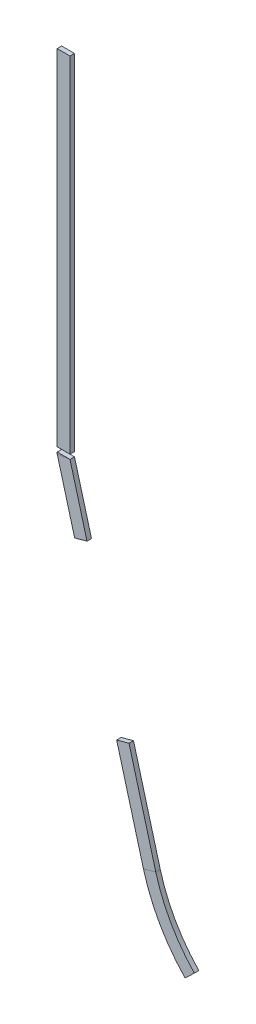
from build123d import *

# Parameters (mm, degrees)
SKETCH3_W          = 40
SKETCH3_H          = 14
SKETCH4_W          = 28
SKETCH4_H          = 498
CUT_EXTRUDE1_DEPTH = 40
SKETCH5_W          = 40
SKETCH5_H          = 14.000000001
CUT_EXTRUDE2_DEPTH = 14


with BuildPart() as part:
    # Sweep1: sweep along a path in Sketch2
    with BuildLine(Plane.XY) as sweep1_path:
        Line((-607.5, 2533), (-607.5, 1440.320997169))
        Line((-607.5, 1440.320997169), (-339.168568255, 456.68315125))
        ThreePointArc((-339.168568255, 456.68315125), (-290.437699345, 338.10001507), (-214.174352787, 235.043915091))
    # Sketch3 → Sweep1 (sweep)
    with BuildSketch(Plane(origin=(-607.5, 2533, 0), x_dir=(-1, 0, 0), z_dir=(0, -1, 0))):
        Rectangle(SKETCH3_W, SKETCH3_H)
    sweep(path=sweep1_path.line, transition=Transition.RIGHT)

    # Sketch4 → Cut-Extrude1 (cut)
    with BuildSketch(Plane(origin=(-219.019723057, -59.747473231, 0), x_dir=(0, 0, 1), z_dir=(-0.9647472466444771, -0.2631781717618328, 0))):
        with Locations((-7, 1096.211652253)):
            Rectangle(SKETCH4_W, SKETCH4_H)
    extrude(amount=-CUT_EXTRUDE1_DEPTH, mode=Mode.SUBTRACT)


with BuildPart() as cut_extrude1_piece_1:
    # of the separate pieces the step leaves, piece 1, a body of its own (cut_extrude1_pieces)
    add(part.part.solids().sort_by_distance((-627.5, 2533, -7))[0])

    # Sketch5 → Cut-Extrude2 (cut)
    with BuildSketch(Plane.XY.offset(7)):
        with Locations((-607.5, 1450)):
            Rectangle(SKETCH5_W, SKETCH5_H)
    extrude(amount=-CUT_EXTRUDE2_DEPTH, mode=Mode.SUBTRACT)


with BuildPart() as cut_extrude1_piece_2:
    # of the separate pieces the step leaves, piece 2, a body of its own (cut_extrude1_pieces)
    add(part.part.solids().sort_by_distance((-441.987336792, 757.597635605, -7))[0])


with BuildPart() as cut_extrude2_piece_1:
    # of the separate pieces the step leaves, piece 1, a body of its own (cut_extrude2_pieces)
    add(cut_extrude1_piece_1.part.solids().sort_by_distance((-627.5, 2533, -7))[0])


with BuildPart() as cut_extrude2_piece_2:
    # of the separate pieces the step leaves, piece 2, a body of its own (cut_extrude2_pieces)
    add(cut_extrude1_piece_1.part.solids().sort_by_distance((-627.5, 1443, -7))[0])


solid = Compound([cut_extrude1_piece_2.part, cut_extrude2_piece_1.part, cut_extrude2_piece_2.part])
